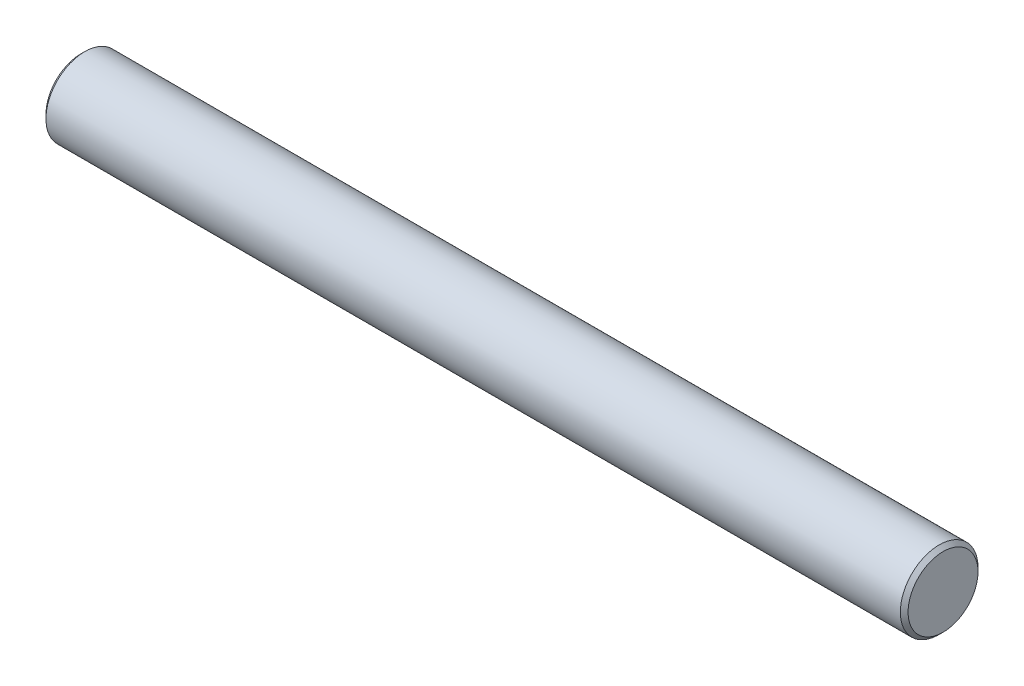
ISO-10303-21;
HEADER;
FILE_DESCRIPTION(('STEP AP214'),'2;1');
FILE_NAME('part.step','',(''),(''),'','','');
FILE_SCHEMA(('AUTOMOTIVE_DESIGN { 1 0 10303 214 1 1 1 1 }'));
ENDSEC;
DATA;
#1=APPLICATION_CONTEXT('core data for automotive mechanical design processes');
#2=APPLICATION_PROTOCOL_DEFINITION('international standard','automotive_design',2000,#1);
#3=PRODUCT_CONTEXT('',#1,'mechanical');
#4=PRODUCT('Part','Part','',(#3));
#5=PRODUCT_RELATED_PRODUCT_CATEGORY('part','',(#4));
#6=PRODUCT_DEFINITION_FORMATION('','',#4);
#7=PRODUCT_DEFINITION_CONTEXT('part definition',#1,'design');
#8=PRODUCT_DEFINITION('design','',#6,#7);
#9=PRODUCT_DEFINITION_SHAPE('','',#8);
#10=(LENGTH_UNIT() NAMED_UNIT(*) SI_UNIT(.MILLI.,.METRE.));
#11=(NAMED_UNIT(*) PLANE_ANGLE_UNIT() SI_UNIT($,.RADIAN.));
#12=(NAMED_UNIT(*) SI_UNIT($,.STERADIAN.) SOLID_ANGLE_UNIT());
#13=UNCERTAINTY_MEASURE_WITH_UNIT(LENGTH_MEASURE(1.E-05),#10,'distance_accuracy_value','');
#14=(GEOMETRIC_REPRESENTATION_CONTEXT(3) GLOBAL_UNCERTAINTY_ASSIGNED_CONTEXT((#13)) GLOBAL_UNIT_ASSIGNED_CONTEXT((#10,
#11,#12)) REPRESENTATION_CONTEXT('',''));
#15=CARTESIAN_POINT('',(0.,0.,0.));
#16=DIRECTION('',(0.,0.,1.));
#17=DIRECTION('',(1.,0.,0.));
#18=AXIS2_PLACEMENT_3D('',#15,#16,#17);
#19=CARTESIAN_POINT('',(222.,0.,0.));
#20=DIRECTION('',(-1.,0.,0.));
#21=DIRECTION('',(0.,0.,1.));
#22=AXIS2_PLACEMENT_3D('',#19,#20,#21);
#23=CYLINDRICAL_SURFACE('',#22,10.);
#24=CARTESIAN_POINT('',(221.,0.,0.));
#25=DIRECTION('',(1.,0.,0.));
#26=DIRECTION('',(0.,0.,-1.));
#27=AXIS2_PLACEMENT_3D('',#24,#25,#26);
#28=CIRCLE('',#27,10.);
#29=CARTESIAN_POINT('',(221.,0.,-10.));
#30=VERTEX_POINT('',#29);
#31=EDGE_CURVE('E9178',#30,#30,#28,.F.);
#32=ORIENTED_EDGE('',*,*,#31,.T.);
#33=EDGE_LOOP('',(#32));
#34=FACE_BOUND('',#33,.T.);
#35=CARTESIAN_POINT('',(1.,0.,0.));
#36=DIRECTION('',(1.,0.,0.));
#37=DIRECTION('',(0.,0.,-1.));
#38=AXIS2_PLACEMENT_3D('',#35,#36,#37);
#39=CIRCLE('',#38,10.);
#40=CARTESIAN_POINT('',(1.,0.,-10.));
#41=VERTEX_POINT('',#40);
#42=EDGE_CURVE('E9182',#41,#41,#39,.T.);
#43=ORIENTED_EDGE('',*,*,#42,.T.);
#44=EDGE_LOOP('',(#43));
#45=FACE_BOUND('',#44,.T.);
#46=ADVANCED_FACE('F9172',(#34,#45),#23,.T.);
#47=CARTESIAN_POINT('',(222.,0.,0.));
#48=DIRECTION('',(1.,0.,0.));
#49=DIRECTION('',(0.,0.,-1.));
#50=AXIS2_PLACEMENT_3D('',#47,#48,#49);
#51=PLANE('',#50);
#52=CARTESIAN_POINT('',(222.,0.,0.));
#53=DIRECTION('',(1.,0.,0.));
#54=DIRECTION('',(0.,0.,-1.));
#55=AXIS2_PLACEMENT_3D('',#52,#53,#54);
#56=CIRCLE('',#55,9.);
#57=CARTESIAN_POINT('',(222.,0.,-9.));
#58=VERTEX_POINT('',#57);
#59=EDGE_CURVE('E9186',#58,#58,#56,.T.);
#60=ORIENTED_EDGE('',*,*,#59,.T.);
#61=EDGE_LOOP('',(#60));
#62=FACE_BOUND('',#61,.T.);
#63=ADVANCED_FACE('F9192',(#62),#51,.T.);
#64=CARTESIAN_POINT('',(0.,0.,0.));
#65=DIRECTION('',(1.,0.,0.));
#66=DIRECTION('',(0.,0.,-1.));
#67=AXIS2_PLACEMENT_3D('',#64,#65,#66);
#68=PLANE('',#67);
#69=CARTESIAN_POINT('',(0.,0.,0.));
#70=DIRECTION('',(1.,0.,0.));
#71=DIRECTION('',(0.,0.,-1.));
#72=AXIS2_PLACEMENT_3D('',#69,#70,#71);
#73=CIRCLE('',#72,8.99999999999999);
#74=CARTESIAN_POINT('',(0.,0.,-8.99999999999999));
#75=VERTEX_POINT('',#74);
#76=EDGE_CURVE('E10',#75,#75,#73,.F.);
#77=ORIENTED_EDGE('',*,*,#76,.T.);
#78=EDGE_LOOP('',(#77));
#79=FACE_BOUND('',#78,.T.);
#80=ADVANCED_FACE('F9197',(#79),#68,.F.);
#81=CARTESIAN_POINT('',(222.,0.,0.));
#82=DIRECTION('',(-1.,0.,0.));
#83=DIRECTION('',(0.,0.,1.));
#84=AXIS2_PLACEMENT_3D('',#81,#82,#83);
#85=CONICAL_SURFACE('',#84,9.,0.785398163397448);
#86=ORIENTED_EDGE('',*,*,#31,.F.);
#87=EDGE_LOOP('',(#86));
#88=FACE_BOUND('',#87,.T.);
#89=ORIENTED_EDGE('',*,*,#59,.F.);
#90=EDGE_LOOP('',(#89));
#91=FACE_BOUND('',#90,.T.);
#92=ADVANCED_FACE('F9194',(#88,#91),#85,.T.);
#93=CARTESIAN_POINT('',(1.,0.,0.));
#94=DIRECTION('',(1.,0.,0.));
#95=DIRECTION('',(0.,0.,-1.));
#96=AXIS2_PLACEMENT_3D('',#93,#94,#95);
#97=CONICAL_SURFACE('',#96,10.,0.785398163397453);
#98=ORIENTED_EDGE('',*,*,#76,.F.);
#99=EDGE_LOOP('',(#98));
#100=FACE_BOUND('',#99,.T.);
#101=ORIENTED_EDGE('',*,*,#42,.F.);
#102=EDGE_LOOP('',(#101));
#103=FACE_BOUND('',#102,.T.);
#104=ADVANCED_FACE('F9196',(#100,#103),#97,.T.);
#105=CLOSED_SHELL('',(#46,#63,#80,#92,#104));
#106=MANIFOLD_SOLID_BREP('B2',#105);
#107=ADVANCED_BREP_SHAPE_REPRESENTATION('',(#18,#106),#14);
#108=SHAPE_DEFINITION_REPRESENTATION(#9,#107);
ENDSEC;
END-ISO-10303-21;
